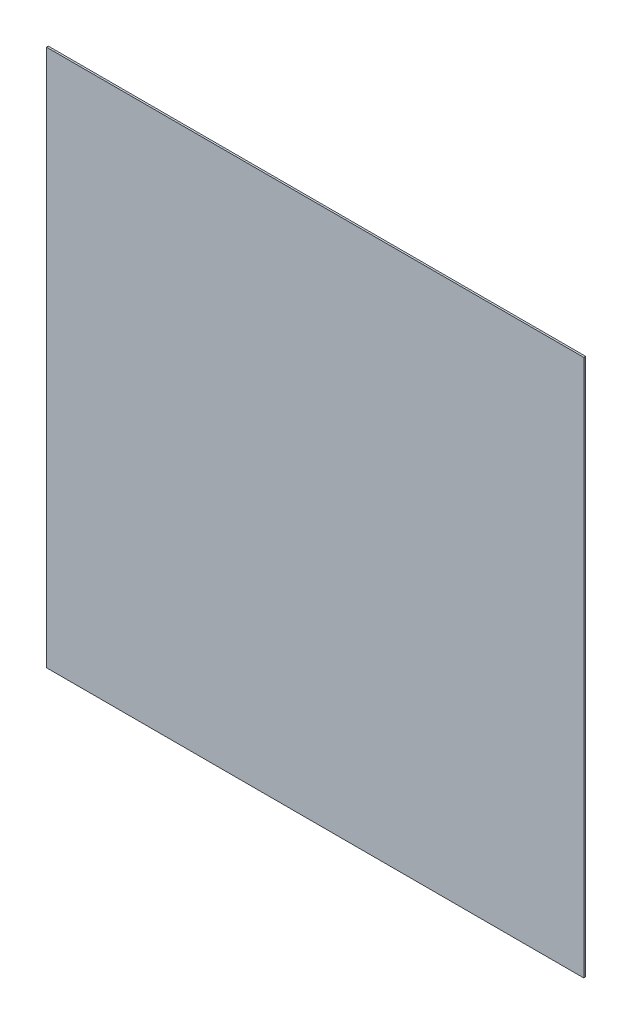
ISO-10303-21;
HEADER;
FILE_DESCRIPTION(('STEP AP214'),'2;1');
FILE_NAME('part.step','',(''),(''),'','','');
FILE_SCHEMA(('AUTOMOTIVE_DESIGN { 1 0 10303 214 1 1 1 1 }'));
ENDSEC;
DATA;
#1=APPLICATION_CONTEXT('core data for automotive mechanical design processes');
#2=APPLICATION_PROTOCOL_DEFINITION('international standard','automotive_design',2000,#1);
#3=PRODUCT_CONTEXT('',#1,'mechanical');
#4=PRODUCT('Part','Part','',(#3));
#5=PRODUCT_RELATED_PRODUCT_CATEGORY('part','',(#4));
#6=PRODUCT_DEFINITION_FORMATION('','',#4);
#7=PRODUCT_DEFINITION_CONTEXT('part definition',#1,'design');
#8=PRODUCT_DEFINITION('design','',#6,#7);
#9=PRODUCT_DEFINITION_SHAPE('','',#8);
#10=(LENGTH_UNIT() NAMED_UNIT(*) SI_UNIT(.MILLI.,.METRE.));
#11=(NAMED_UNIT(*) PLANE_ANGLE_UNIT() SI_UNIT($,.RADIAN.));
#12=(NAMED_UNIT(*) SI_UNIT($,.STERADIAN.) SOLID_ANGLE_UNIT());
#13=UNCERTAINTY_MEASURE_WITH_UNIT(LENGTH_MEASURE(1.E-05),#10,'distance_accuracy_value','');
#14=(GEOMETRIC_REPRESENTATION_CONTEXT(3) GLOBAL_UNCERTAINTY_ASSIGNED_CONTEXT((#13)) GLOBAL_UNIT_ASSIGNED_CONTEXT((#10,
#11,#12)) REPRESENTATION_CONTEXT('',''));
#15=CARTESIAN_POINT('',(0.,0.,0.));
#16=DIRECTION('',(0.,0.,1.));
#17=DIRECTION('',(1.,0.,0.));
#18=AXIS2_PLACEMENT_3D('',#15,#16,#17);
#19=CARTESIAN_POINT('',(0.,0.,1.5875));
#20=DIRECTION('',(1.,0.,0.));
#21=DIRECTION('',(0.,0.,-1.));
#22=AXIS2_PLACEMENT_3D('',#19,#20,#21);
#23=PLANE('',#22);
#24=DIRECTION('',(0.,-1.,0.));
#25=VECTOR('',#24,1.);
#26=CARTESIAN_POINT('',(0.,0.,0.));
#27=LINE('',#26,#25);
#28=CARTESIAN_POINT('',(0.,457.2,0.));
#29=VERTEX_POINT('',#28);
#30=CARTESIAN_POINT('',(0.,0.,0.));
#31=VERTEX_POINT('',#30);
#32=EDGE_CURVE('E73',#29,#31,#27,.T.);
#33=ORIENTED_EDGE('',*,*,#32,.T.);
#34=DIRECTION('',(0.,0.,-1.));
#35=VECTOR('',#34,1.);
#36=CARTESIAN_POINT('',(0.,0.,1.5875));
#37=LINE('',#36,#35);
#38=CARTESIAN_POINT('',(0.,0.,1.5875));
#39=VERTEX_POINT('',#38);
#40=EDGE_CURVE('E11',#39,#31,#37,.T.);
#41=ORIENTED_EDGE('',*,*,#40,.F.);
#42=DIRECTION('',(0.,-1.,0.));
#43=VECTOR('',#42,1.);
#44=CARTESIAN_POINT('',(0.,0.,1.5875));
#45=LINE('',#44,#43);
#46=CARTESIAN_POINT('',(0.,457.2,1.5875));
#47=VERTEX_POINT('',#46);
#48=EDGE_CURVE('E91',#47,#39,#45,.T.);
#49=ORIENTED_EDGE('',*,*,#48,.F.);
#50=DIRECTION('',(0.,0.,-1.));
#51=VECTOR('',#50,1.);
#52=CARTESIAN_POINT('',(0.,457.2,1.5875));
#53=LINE('',#52,#51);
#54=EDGE_CURVE('E85',#47,#29,#53,.T.);
#55=ORIENTED_EDGE('',*,*,#54,.T.);
#56=EDGE_LOOP('',(#33,#41,#49,#55));
#57=FACE_BOUND('',#56,.T.);
#58=ADVANCED_FACE('F29',(#57),#23,.F.);
#59=CARTESIAN_POINT('',(0.,0.,1.5875));
#60=DIRECTION('',(0.,1.,0.));
#61=DIRECTION('',(-1.,0.,0.));
#62=AXIS2_PLACEMENT_3D('',#59,#60,#61);
#63=PLANE('',#62);
#64=DIRECTION('',(1.,0.,0.));
#65=VECTOR('',#64,1.);
#66=CARTESIAN_POINT('',(0.,0.,0.));
#67=LINE('',#66,#65);
#68=CARTESIAN_POINT('',(457.2,0.,0.));
#69=VERTEX_POINT('',#68);
#70=EDGE_CURVE('E69',#31,#69,#67,.T.);
#71=ORIENTED_EDGE('',*,*,#70,.T.);
#72=DIRECTION('',(0.,0.,-1.));
#73=VECTOR('',#72,1.);
#74=CARTESIAN_POINT('',(457.2,0.,1.5875));
#75=LINE('',#74,#73);
#76=CARTESIAN_POINT('',(457.2,0.,1.5875));
#77=VERTEX_POINT('',#76);
#78=EDGE_CURVE('E36',#77,#69,#75,.T.);
#79=ORIENTED_EDGE('',*,*,#78,.F.);
#80=DIRECTION('',(1.,0.,0.));
#81=VECTOR('',#80,1.);
#82=CARTESIAN_POINT('',(0.,0.,1.5875));
#83=LINE('',#82,#81);
#84=EDGE_CURVE('E81',#39,#77,#83,.T.);
#85=ORIENTED_EDGE('',*,*,#84,.F.);
#86=ORIENTED_EDGE('',*,*,#40,.T.);
#87=EDGE_LOOP('',(#71,#79,#85,#86));
#88=FACE_BOUND('',#87,.T.);
#89=ADVANCED_FACE('F80',(#88),#63,.F.);
#90=CARTESIAN_POINT('',(457.2,0.,1.5875));
#91=DIRECTION('',(-1.,0.,0.));
#92=DIRECTION('',(0.,0.,1.));
#93=AXIS2_PLACEMENT_3D('',#90,#91,#92);
#94=PLANE('',#93);
#95=DIRECTION('',(0.,1.,0.));
#96=VECTOR('',#95,1.);
#97=CARTESIAN_POINT('',(457.2,0.,0.));
#98=LINE('',#97,#96);
#99=CARTESIAN_POINT('',(457.2,457.2,0.));
#100=VERTEX_POINT('',#99);
#101=EDGE_CURVE('E74',#69,#100,#98,.T.);
#102=ORIENTED_EDGE('',*,*,#101,.T.);
#103=DIRECTION('',(0.,0.,-1.));
#104=VECTOR('',#103,1.);
#105=CARTESIAN_POINT('',(457.2,457.2,1.5875));
#106=LINE('',#105,#104);
#107=CARTESIAN_POINT('',(457.2,457.2,1.5875));
#108=VERTEX_POINT('',#107);
#109=EDGE_CURVE('E97',#108,#100,#106,.T.);
#110=ORIENTED_EDGE('',*,*,#109,.F.);
#111=DIRECTION('',(0.,1.,0.));
#112=VECTOR('',#111,1.);
#113=CARTESIAN_POINT('',(457.2,0.,1.5875));
#114=LINE('',#113,#112);
#115=EDGE_CURVE('E48',#77,#108,#114,.T.);
#116=ORIENTED_EDGE('',*,*,#115,.F.);
#117=ORIENTED_EDGE('',*,*,#78,.T.);
#118=EDGE_LOOP('',(#102,#110,#116,#117));
#119=FACE_BOUND('',#118,.T.);
#120=ADVANCED_FACE('F100',(#119),#94,.F.);
#121=CARTESIAN_POINT('',(0.,457.2,1.5875));
#122=DIRECTION('',(0.,-1.,0.));
#123=DIRECTION('',(1.,0.,0.));
#124=AXIS2_PLACEMENT_3D('',#121,#122,#123);
#125=PLANE('',#124);
#126=DIRECTION('',(-1.,0.,0.));
#127=VECTOR('',#126,1.);
#128=CARTESIAN_POINT('',(0.,457.2,0.));
#129=LINE('',#128,#127);
#130=EDGE_CURVE('E89',#100,#29,#129,.T.);
#131=ORIENTED_EDGE('',*,*,#130,.T.);
#132=ORIENTED_EDGE('',*,*,#54,.F.);
#133=DIRECTION('',(-1.,0.,0.));
#134=VECTOR('',#133,1.);
#135=CARTESIAN_POINT('',(0.,457.2,1.5875));
#136=LINE('',#135,#134);
#137=EDGE_CURVE('E43',#108,#47,#136,.T.);
#138=ORIENTED_EDGE('',*,*,#137,.F.);
#139=ORIENTED_EDGE('',*,*,#109,.T.);
#140=EDGE_LOOP('',(#131,#132,#138,#139));
#141=FACE_BOUND('',#140,.T.);
#142=ADVANCED_FACE('F102',(#141),#125,.F.);
#143=CARTESIAN_POINT('',(0.,457.2,1.5875));
#144=DIRECTION('',(0.,0.,-1.));
#145=DIRECTION('',(-1.,0.,0.));
#146=AXIS2_PLACEMENT_3D('',#143,#144,#145);
#147=PLANE('',#146);
#148=ORIENTED_EDGE('',*,*,#48,.T.);
#149=ORIENTED_EDGE('',*,*,#84,.T.);
#150=ORIENTED_EDGE('',*,*,#115,.T.);
#151=ORIENTED_EDGE('',*,*,#137,.T.);
#152=EDGE_LOOP('',(#148,#149,#150,#151));
#153=FACE_BOUND('',#152,.T.);
#154=ADVANCED_FACE('F103',(#153),#147,.F.);
#155=CARTESIAN_POINT('',(0.,457.2,0.));
#156=DIRECTION('',(0.,0.,-1.));
#157=DIRECTION('',(-1.,0.,0.));
#158=AXIS2_PLACEMENT_3D('',#155,#156,#157);
#159=PLANE('',#158);
#160=ORIENTED_EDGE('',*,*,#32,.F.);
#161=ORIENTED_EDGE('',*,*,#130,.F.);
#162=ORIENTED_EDGE('',*,*,#101,.F.);
#163=ORIENTED_EDGE('',*,*,#70,.F.);
#164=EDGE_LOOP('',(#160,#161,#162,#163));
#165=FACE_BOUND('',#164,.T.);
#166=ADVANCED_FACE('F70',(#165),#159,.T.);
#167=CLOSED_SHELL('',(#58,#89,#120,#142,#154,#166));
#168=MANIFOLD_SOLID_BREP('B2',#167);
#169=ADVANCED_BREP_SHAPE_REPRESENTATION('',(#18,#168),#14);
#170=SHAPE_DEFINITION_REPRESENTATION(#9,#169);
ENDSEC;
END-ISO-10303-21;
